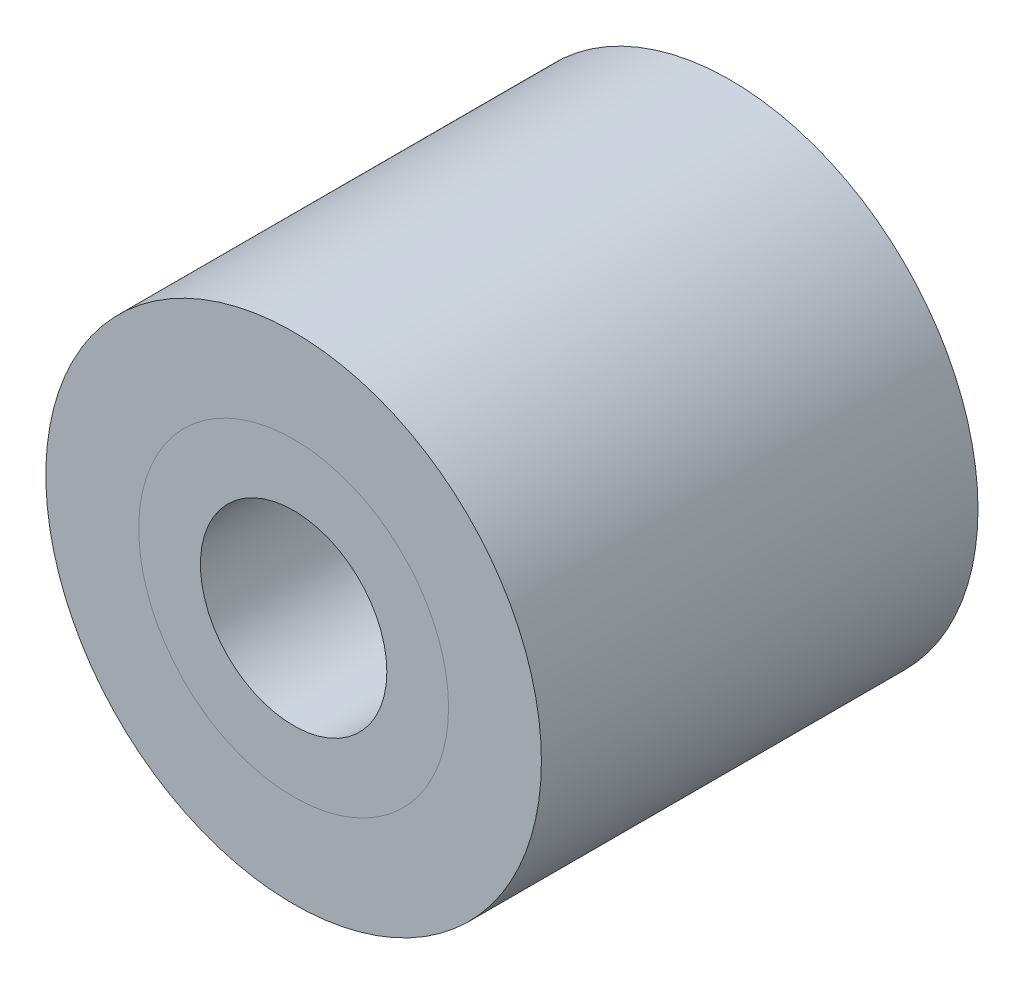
ISO-10303-21;
HEADER;
FILE_DESCRIPTION(('STEP AP214'),'2;1');
FILE_NAME('part.step','',(''),(''),'','','');
FILE_SCHEMA(('AUTOMOTIVE_DESIGN { 1 0 10303 214 1 1 1 1 }'));
ENDSEC;
DATA;
#1=APPLICATION_CONTEXT('core data for automotive mechanical design processes');
#2=APPLICATION_PROTOCOL_DEFINITION('international standard','automotive_design',2000,#1);
#3=PRODUCT_CONTEXT('',#1,'mechanical');
#4=PRODUCT('Part','Part','',(#3));
#5=PRODUCT_RELATED_PRODUCT_CATEGORY('part','',(#4));
#6=PRODUCT_DEFINITION_FORMATION('','',#4);
#7=PRODUCT_DEFINITION_CONTEXT('part definition',#1,'design');
#8=PRODUCT_DEFINITION('design','',#6,#7);
#9=PRODUCT_DEFINITION_SHAPE('','',#8);
#10=(LENGTH_UNIT() NAMED_UNIT(*) SI_UNIT(.MILLI.,.METRE.));
#11=(NAMED_UNIT(*) PLANE_ANGLE_UNIT() SI_UNIT($,.RADIAN.));
#12=(NAMED_UNIT(*) SI_UNIT($,.STERADIAN.) SOLID_ANGLE_UNIT());
#13=UNCERTAINTY_MEASURE_WITH_UNIT(LENGTH_MEASURE(1.E-05),#10,'distance_accuracy_value','');
#14=(GEOMETRIC_REPRESENTATION_CONTEXT(3) GLOBAL_UNCERTAINTY_ASSIGNED_CONTEXT((#13)) GLOBAL_UNIT_ASSIGNED_CONTEXT((#10,
#11,#12)) REPRESENTATION_CONTEXT('',''));
#15=CARTESIAN_POINT('',(0.,0.,0.));
#16=DIRECTION('',(0.,0.,1.));
#17=DIRECTION('',(1.,0.,0.));
#18=AXIS2_PLACEMENT_3D('',#15,#16,#17);
#19=CARTESIAN_POINT('',(0.,0.,-37.01));
#20=DIRECTION('',(0.,0.,1.));
#21=DIRECTION('',(1.,0.,0.));
#22=AXIS2_PLACEMENT_3D('',#19,#20,#21);
#23=CYLINDRICAL_SURFACE('',#22,13.13);
#24=CARTESIAN_POINT('',(0.,0.,0.));
#25=DIRECTION('',(0.,0.,1.));
#26=DIRECTION('',(1.,0.,0.));
#27=AXIS2_PLACEMENT_3D('',#24,#25,#26);
#28=CIRCLE('',#27,13.13);
#29=CARTESIAN_POINT('',(13.13,0.,0.));
#30=VERTEX_POINT('',#29);
#31=EDGE_CURVE('E59',#30,#30,#28,.T.);
#32=ORIENTED_EDGE('',*,*,#31,.F.);
#33=EDGE_LOOP('',(#32));
#34=FACE_BOUND('',#33,.T.);
#35=CARTESIAN_POINT('',(0.,0.,-37.));
#36=DIRECTION('',(0.,0.,1.));
#37=DIRECTION('',(1.,0.,0.));
#38=AXIS2_PLACEMENT_3D('',#35,#36,#37);
#39=CIRCLE('',#38,13.13);
#40=CARTESIAN_POINT('',(13.13,0.,-37.));
#41=VERTEX_POINT('',#40);
#42=EDGE_CURVE('E68',#41,#41,#39,.T.);
#43=ORIENTED_EDGE('',*,*,#42,.T.);
#44=EDGE_LOOP('',(#43));
#45=FACE_BOUND('',#44,.T.);
#46=CARTESIAN_POINT('',(0.,13.13,-20.5));
#47=CARTESIAN_POINT('',(0.111647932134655,13.1299981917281,-20.4999954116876));
#48=CARTESIAN_POINT('',(0.223360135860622,13.1285610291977,-20.4906194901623));
#49=CARTESIAN_POINT('',(0.443660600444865,13.122966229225,-20.4533738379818));
#50=CARTESIAN_POINT('',(0.552245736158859,13.118805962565,-20.4254862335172));
#51=CARTESIAN_POINT('',(0.763072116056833,13.1082323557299,-20.3520710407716));
#52=CARTESIAN_POINT('',(0.86531813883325,13.1018207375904,-20.3065569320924));
#53=CARTESIAN_POINT('',(1.06070636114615,13.0874524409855,-20.199213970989));
#54=CARTESIAN_POINT('',(1.15384979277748,13.0794959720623,-20.1373873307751));
#55=CARTESIAN_POINT('',(1.32915351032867,13.0628508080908,-19.998644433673));
#56=CARTESIAN_POINT('',(1.41122994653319,13.054157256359,-19.9216228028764));
#57=CARTESIAN_POINT('',(1.56134626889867,13.0370556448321,-19.7549030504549));
#58=CARTESIAN_POINT('',(1.6293853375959,13.0286476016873,-19.665204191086));
#59=CARTESIAN_POINT('',(1.74982325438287,13.0130218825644,-19.4751111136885));
#60=CARTESIAN_POINT('',(1.80214073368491,13.0058104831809,-19.3746647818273));
#61=CARTESIAN_POINT('',(1.88913032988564,12.9934610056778,-19.1662823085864));
#62=CARTESIAN_POINT('',(1.92380343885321,12.9883228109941,-19.0583465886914));
#63=CARTESIAN_POINT('',(1.9742591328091,12.9807493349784,-18.8389320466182));
#64=CARTESIAN_POINT('',(1.99018543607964,12.9782935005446,-18.727486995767));
#65=CARTESIAN_POINT('',(2.0031407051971,12.9763004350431,-18.5034812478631));
#66=CARTESIAN_POINT('',(2.00017078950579,12.9767630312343,-18.3909206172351));
#67=CARTESIAN_POINT('',(1.97553532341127,12.9805357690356,-18.1688955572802));
#68=CARTESIAN_POINT('',(1.95403002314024,12.9838215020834,-18.0594128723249));
#69=CARTESIAN_POINT('',(1.8931851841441,12.9928321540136,-17.8456281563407));
#70=CARTESIAN_POINT('',(1.85384512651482,12.9985571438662,-17.7413262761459));
#71=CARTESIAN_POINT('',(1.75828138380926,13.0118281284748,-17.54037739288));
#72=CARTESIAN_POINT('',(1.70198999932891,13.0193814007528,-17.4437630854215));
#73=CARTESIAN_POINT('',(1.57416970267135,13.0354526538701,-17.2612908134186));
#74=CARTESIAN_POINT('',(1.50263975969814,13.0439706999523,-17.1754335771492));
#75=CARTESIAN_POINT('',(1.34549404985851,13.0611194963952,-17.0159840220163));
#76=CARTESIAN_POINT('',(1.25974054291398,13.0697505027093,-16.9425274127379));
#77=CARTESIAN_POINT('',(1.0770509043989,13.0860711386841,-16.8110274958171));
#78=CARTESIAN_POINT('',(0.980114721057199,13.0937607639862,-16.7529842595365));
#79=CARTESIAN_POINT('',(0.777692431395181,13.1073406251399,-16.6539510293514));
#80=CARTESIAN_POINT('',(0.672201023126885,13.1132297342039,-16.6129717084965));
#81=CARTESIAN_POINT('',(0.45572389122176,13.1225356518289,-16.5493486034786));
#82=CARTESIAN_POINT('',(0.344738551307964,13.125952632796,-16.5267035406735));
#83=CARTESIAN_POINT('',(0.121595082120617,13.1299064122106,-16.5005726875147));
#84=CARTESIAN_POINT('',(0.00945927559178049,13.130471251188,-16.4969003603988));
#85=CARTESIAN_POINT('',(-0.21382664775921,13.1287334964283,-16.5083238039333));
#86=CARTESIAN_POINT('',(-0.324976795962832,13.1264309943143,-16.5234189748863));
#87=CARTESIAN_POINT('',(-0.542569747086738,13.1192346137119,-16.5717937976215));
#88=CARTESIAN_POINT('',(-0.649033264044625,13.1143537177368,-16.6049823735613));
#89=CARTESIAN_POINT('',(-0.854884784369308,13.1025459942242,-16.6885057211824));
#90=CARTESIAN_POINT('',(-0.954272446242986,13.0956190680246,-16.7388413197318));
#91=CARTESIAN_POINT('',(-1.14396992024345,13.0804192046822,-16.8556661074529));
#92=CARTESIAN_POINT('',(-1.23420621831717,13.0721365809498,-16.9222733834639));
#93=CARTESIAN_POINT('',(-1.40228651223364,13.0551768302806,-17.0695866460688));
#94=CARTESIAN_POINT('',(-1.48012976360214,13.046499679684,-17.15029347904));
#95=CARTESIAN_POINT('',(-1.6218947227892,13.0296396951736,-17.3243461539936));
#96=CARTESIAN_POINT('',(-1.68569125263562,13.0214617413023,-17.417794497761));
#97=CARTESIAN_POINT('',(-1.79668116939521,13.0066131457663,-17.6141906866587));
#98=CARTESIAN_POINT('',(-1.84387501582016,12.9999424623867,-17.7171382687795));
#99=CARTESIAN_POINT('',(-1.92012679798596,12.9888991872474,-17.9292404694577));
#100=CARTESIAN_POINT('',(-1.94925013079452,12.9845183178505,-18.0383711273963));
#101=CARTESIAN_POINT('',(-1.98874202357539,12.9785288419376,-18.260046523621));
#102=CARTESIAN_POINT('',(-1.99911192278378,12.976920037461,-18.3725910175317));
#103=CARTESIAN_POINT('',(-2.00076998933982,12.9766643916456,-18.5966513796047));
#104=CARTESIAN_POINT('',(-1.99225500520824,12.9779869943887,-18.7081658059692));
#105=CARTESIAN_POINT('',(-1.95680735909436,12.9833786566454,-18.9281567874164));
#106=CARTESIAN_POINT('',(-1.92987473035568,12.9874477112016,-19.036633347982));
#107=CARTESIAN_POINT('',(-1.85842670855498,12.9978629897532,-19.2474119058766));
#108=CARTESIAN_POINT('',(-1.81392550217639,13.0042073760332,-19.3497188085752));
#109=CARTESIAN_POINT('',(-1.70862321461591,13.018460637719,-19.545446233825));
#110=CARTESIAN_POINT('',(-1.64782154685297,13.026369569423,-19.6388664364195));
#111=CARTESIAN_POINT('',(-1.51093077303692,13.0429588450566,-19.8151679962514));
#112=CARTESIAN_POINT('',(-1.43469599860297,13.0516460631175,-19.8979356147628));
#113=CARTESIAN_POINT('',(-1.26941088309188,13.0687560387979,-20.0495728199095));
#114=CARTESIAN_POINT('',(-1.1803575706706,13.077178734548,-20.1184391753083));
#115=CARTESIAN_POINT('',(-0.991366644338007,13.0928654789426,-20.2406699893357));
#116=CARTESIAN_POINT('',(-0.891370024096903,13.1001226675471,-20.2939440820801));
#117=CARTESIAN_POINT('',(-0.683783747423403,13.1125935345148,-20.3828603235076));
#118=CARTESIAN_POINT('',(-0.576202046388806,13.1178093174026,-20.4185206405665));
#119=CARTESIAN_POINT('',(-0.390121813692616,13.1244260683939,-20.4631535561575));
#120=CARTESIAN_POINT('',(-0.3127689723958,13.12650549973,-20.47694972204));
#121=CARTESIAN_POINT('',(-0.156954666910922,13.129293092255,-20.4953744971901));
#122=CARTESIAN_POINT('',(-0.0784932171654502,13.1300012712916,-20.5000032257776));
#123=CARTESIAN_POINT('',(0.,13.13,-20.5));
#124=B_SPLINE_CURVE_WITH_KNOTS('',3,(#46,#47,#48,#49,#50,#51,#52,#53,#54,#55,#56,#57,#58,#59,
#60,#61,#62,#63,#64,#65,#66,#67,#68,#69,#70,#71,#72,#73,#74,#75,#76,#77,#78,#79,#80,#81,#82,#83,
#84,#85,#86,#87,#88,#89,#90,#91,#92,#93,#94,#95,#96,#97,#98,#99,#100,#101,#102,#103,#104,#105,
#106,#107,#108,#109,#110,#111,#112,#113,#114,#115,#116,#117,#118,#119,#120,#121,#122,#123),
.UNSPECIFIED.,.T.,.F.,(4,2,2,2,2,2,2,2,2,2,2,2,2,2,2,2,2,2,2,2,2,2,2,2,2,2,2,2,2,2,2,2,2,2,2,2,
2,2,4),(0.,0.334656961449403,0.669637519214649,1.00436240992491,1.33904193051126,
1.67612958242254,2.01323685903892,2.35205995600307,2.69086400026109,3.02705340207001,
3.36322290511,3.69651483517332,4.02981646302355,4.36446727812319,4.69914073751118,
5.03726782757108,5.37539648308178,5.71373631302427,6.05205254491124,6.38703609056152,
6.72200893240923,7.05531100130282,7.38862914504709,7.72444211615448,8.06027525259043,
8.39898985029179,8.73769507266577,9.07516726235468,9.41261535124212,9.74656256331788,
10.0805091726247,10.4141866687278,10.747876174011,11.0848758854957,11.421953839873,
11.7609483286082,12.0995924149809,12.3348734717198,12.5701514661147),.UNSPECIFIED.);
#125=CARTESIAN_POINT('',(0.,13.13,-20.5));
#126=VERTEX_POINT('',#125);
#127=EDGE_CURVE('E62',#126,#126,#124,.T.);
#128=ORIENTED_EDGE('',*,*,#127,.T.);
#129=EDGE_LOOP('',(#128));
#130=FACE_BOUND('',#129,.T.);
#131=ADVANCED_FACE('F42',(#34,#45,#130),#23,.T.);
#132=CARTESIAN_POINT('',(0.,0.,-37.));
#133=DIRECTION('',(0.,0.,1.));
#134=DIRECTION('',(1.,0.,0.));
#135=AXIS2_PLACEMENT_3D('',#132,#133,#134);
#136=CYLINDRICAL_SURFACE('',#135,7.9);
#137=CARTESIAN_POINT('',(0.,0.,0.));
#138=DIRECTION('',(0.,0.,1.));
#139=DIRECTION('',(1.,0.,0.));
#140=AXIS2_PLACEMENT_3D('',#137,#138,#139);
#141=CIRCLE('',#140,7.9);
#142=CARTESIAN_POINT('',(7.9,0.,0.));
#143=VERTEX_POINT('',#142);
#144=EDGE_CURVE('E11',#143,#143,#141,.T.);
#145=ORIENTED_EDGE('',*,*,#144,.T.);
#146=EDGE_LOOP('',(#145));
#147=FACE_BOUND('',#146,.T.);
#148=CARTESIAN_POINT('',(0.,0.,-37.));
#149=DIRECTION('',(0.,0.,1.));
#150=DIRECTION('',(1.,0.,0.));
#151=AXIS2_PLACEMENT_3D('',#148,#149,#150);
#152=CIRCLE('',#151,7.9);
#153=CARTESIAN_POINT('',(7.9,0.,-37.));
#154=VERTEX_POINT('',#153);
#155=EDGE_CURVE('E54',#154,#154,#152,.T.);
#156=ORIENTED_EDGE('',*,*,#155,.F.);
#157=EDGE_LOOP('',(#156));
#158=FACE_BOUND('',#157,.T.);
#159=CARTESIAN_POINT('',(0.,7.9,-20.5));
#160=CARTESIAN_POINT('',(0.110455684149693,7.89999816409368,-20.4999969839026));
#161=CARTESIAN_POINT('',(0.220944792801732,7.8976604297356,-20.4908188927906));
#162=CARTESIAN_POINT('',(0.438753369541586,7.88856135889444,-20.4544058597));
#163=CARTESIAN_POINT('',(0.5460710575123,7.88179758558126,-20.4271609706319));
#164=CARTESIAN_POINT('',(0.754360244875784,7.86459496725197,-20.3555468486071));
#165=CARTESIAN_POINT('',(0.855339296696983,7.85416059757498,-20.31119846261));
#166=CARTESIAN_POINT('',(1.04842483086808,7.83072646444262,-20.2067103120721));
#167=CARTESIAN_POINT('',(1.14053095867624,7.8177265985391,-20.1465699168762));
#168=CARTESIAN_POINT('',(1.31519757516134,7.79026495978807,-20.0108660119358));
#169=CARTESIAN_POINT('',(1.39754439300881,7.77578017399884,-19.9350321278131));
#170=CARTESIAN_POINT('',(1.54849735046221,7.74713314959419,-19.7706725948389));
#171=CARTESIAN_POINT('',(1.61710189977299,7.73297094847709,-19.6821454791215));
#172=CARTESIAN_POINT('',(1.73963462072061,7.7063399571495,-19.4932447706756));
#173=CARTESIAN_POINT('',(1.7933225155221,7.69390034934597,-19.3927108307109));
#174=CARTESIAN_POINT('',(1.88295228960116,7.67245912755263,-19.1836785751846));
#175=CARTESIAN_POINT('',(1.91889708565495,7.66345694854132,-19.0751815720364));
#176=CARTESIAN_POINT('',(1.97128895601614,7.6501465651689,-18.8556557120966));
#177=CARTESIAN_POINT('',(1.98812081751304,7.64574587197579,-18.7447244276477));
#178=CARTESIAN_POINT('',(2.00300778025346,7.64185997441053,-18.5215320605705));
#179=CARTESIAN_POINT('',(2.00106601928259,7.64237394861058,-18.409271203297));
#180=CARTESIAN_POINT('',(1.97876757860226,7.64817623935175,-18.1895654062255));
#181=CARTESIAN_POINT('',(1.95887071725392,7.65334533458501,-18.082070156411));
#182=CARTESIAN_POINT('',(1.90196093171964,7.66768527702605,-17.871995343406));
#183=CARTESIAN_POINT('',(1.86494676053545,7.67685641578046,-17.769416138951));
#184=CARTESIAN_POINT('',(1.77446439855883,7.69827566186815,-17.5708586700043));
#185=CARTESIAN_POINT('',(1.72083038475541,7.71055453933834,-17.4749594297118));
#186=CARTESIAN_POINT('',(1.59874672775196,7.73678852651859,-17.2933578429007));
#187=CARTESIAN_POINT('',(1.53029443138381,7.7507439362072,-17.2076573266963));
#188=CARTESIAN_POINT('',(1.37814120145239,7.77925948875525,-17.0462523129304));
#189=CARTESIAN_POINT('',(1.29405258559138,7.79382537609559,-16.9709138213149));
#190=CARTESIAN_POINT('',(1.11425951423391,7.82155271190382,-16.8353371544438));
#191=CARTESIAN_POINT('',(1.01855468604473,7.83471411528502,-16.77509946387));
#192=CARTESIAN_POINT('',(0.817715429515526,7.85821780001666,-16.6712950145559));
#193=CARTESIAN_POINT('',(0.712548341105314,7.868549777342,-16.6277889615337));
#194=CARTESIAN_POINT('',(0.496073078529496,7.88515563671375,-16.559176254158));
#195=CARTESIAN_POINT('',(0.384766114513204,7.89143031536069,-16.53406598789));
#196=CARTESIAN_POINT('',(0.162298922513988,7.89909622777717,-16.5035195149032));
#197=CARTESIAN_POINT('',(0.0512112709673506,7.90061111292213,-16.4975850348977));
#198=CARTESIAN_POINT('',(-0.170370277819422,7.89893954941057,-16.5041902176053));
#199=CARTESIAN_POINT('',(-0.28086422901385,7.89575353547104,-16.5167281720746));
#200=CARTESIAN_POINT('',(-0.496381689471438,7.88511751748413,-16.5595119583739));
#201=CARTESIAN_POINT('',(-0.601462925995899,7.87773327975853,-16.5894848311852));
#202=CARTESIAN_POINT('',(-0.805099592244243,7.8595340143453,-16.6659748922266));
#203=CARTESIAN_POINT('',(-0.903654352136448,7.84871863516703,-16.7124937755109));
#204=CARTESIAN_POINT('',(-1.09341434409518,7.82456180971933,-16.8217133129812));
#205=CARTESIAN_POINT('',(-1.18445430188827,7.81117819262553,-16.8846915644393));
#206=CARTESIAN_POINT('',(-1.35485026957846,7.78343409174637,-17.0246883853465));
#207=CARTESIAN_POINT('',(-1.43420420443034,7.76907343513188,-17.1017094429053));
#208=CARTESIAN_POINT('',(-1.58103757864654,7.74054683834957,-17.2699213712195));
#209=CARTESIAN_POINT('',(-1.64816709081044,7.72639494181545,-17.3614206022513));
#210=CARTESIAN_POINT('',(-1.76611992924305,7.70029116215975,-17.5546782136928));
#211=CARTESIAN_POINT('',(-1.81694397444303,7.68833918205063,-17.6564361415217));
#212=CARTESIAN_POINT('',(-1.90046316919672,7.66812147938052,-17.8667820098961));
#213=CARTESIAN_POINT('',(-1.93326558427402,7.65983400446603,-17.9753251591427));
#214=CARTESIAN_POINT('',(-1.98008836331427,7.64786539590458,-18.196628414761));
#215=CARTESIAN_POINT('',(-1.99411296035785,7.64418322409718,-18.3093875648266));
#216=CARTESIAN_POINT('',(-2.00275659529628,7.64192268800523,-18.5323572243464));
#217=CARTESIAN_POINT('',(-1.99793548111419,7.64319707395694,-18.6425448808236));
#218=CARTESIAN_POINT('',(-1.97030906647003,7.65036481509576,-18.8604811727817));
#219=CARTESIAN_POINT('',(-1.94750414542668,7.65625807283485,-18.9682298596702));
#220=CARTESIAN_POINT('',(-1.88486680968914,7.67191641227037,-19.1776031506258));
#221=CARTESIAN_POINT('',(-1.84514192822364,7.68165701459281,-19.2792618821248));
#222=CARTESIAN_POINT('',(-1.74987702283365,7.70391540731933,-19.4745450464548));
#223=CARTESIAN_POINT('',(-1.69433475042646,7.71643359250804,-19.5681683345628));
#224=CARTESIAN_POINT('',(-1.56726739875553,7.74325442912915,-19.7474222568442));
#225=CARTESIAN_POINT('',(-1.49535503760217,7.7575958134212,-19.8327726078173));
#226=CARTESIAN_POINT('',(-1.33834018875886,7.78621875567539,-19.9903765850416));
#227=CARTESIAN_POINT('',(-1.25323456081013,7.80050029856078,-20.0626270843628));
#228=CARTESIAN_POINT('',(-1.07032790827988,7.82771329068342,-20.1933000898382));
#229=CARTESIAN_POINT('',(-0.972319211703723,7.84061449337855,-20.2514386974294));
#230=CARTESIAN_POINT('',(-0.767600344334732,7.86329202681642,-20.3503219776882));
#231=CARTESIAN_POINT('',(-0.660896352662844,7.87307055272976,-20.3910788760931));
#232=CARTESIAN_POINT('',(-0.462016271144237,7.8869886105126,-20.4481268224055));
#233=CARTESIAN_POINT('',(-0.370771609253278,7.89183399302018,-20.4675366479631));
#234=CARTESIAN_POINT('',(-0.18635912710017,7.89834033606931,-20.4934739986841));
#235=CARTESIAN_POINT('',(-0.0931914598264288,7.90000154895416,-20.5000025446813));
#236=CARTESIAN_POINT('',(0.,7.9,-20.5));
#237=B_SPLINE_CURVE_WITH_KNOTS('',3,(#159,#160,#161,#162,#163,#164,#165,#166,#167,#168,#169,
#170,#171,#172,#173,#174,#175,#176,#177,#178,#179,#180,#181,#182,#183,#184,#185,#186,#187,#188,
#189,#190,#191,#192,#193,#194,#195,#196,#197,#198,#199,#200,#201,#202,#203,#204,#205,#206,#207,
#208,#209,#210,#211,#212,#213,#214,#215,#216,#217,#218,#219,#220,#221,#222,#223,#224,#225,#226,
#227,#228,#229,#230,#231,#232,#233,#234,#235,#236),.UNSPECIFIED.,.T.,.F.,(4,2,2,2,2,2,2,2,2,2,2,
2,2,2,2,2,2,2,2,2,2,2,2,2,2,2,2,2,2,2,2,2,2,2,2,2,2,2,4),(0.,0.331025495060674,
0.662233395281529,0.993038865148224,1.32385754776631,1.66093776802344,1.99805697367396,
2.34032744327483,2.68254162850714,3.01773682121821,3.35287599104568,3.67966869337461,
4.00648520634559,4.33667362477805,4.66692121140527,5.00683514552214,5.34675998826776,
5.6879067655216,6.02898654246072,6.36112910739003,6.69324095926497,7.02028814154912,
7.34736883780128,7.68036850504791,8.01342723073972,8.3548852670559,8.69632824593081,
9.03571629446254,9.37502782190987,9.70433716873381,10.0336395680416,10.3608796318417,
10.6881662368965,11.0241948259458,11.3603035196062,11.7026984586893,12.0448521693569,
12.3241605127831,12.6034467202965),.UNSPECIFIED.);
#238=CARTESIAN_POINT('',(0.,7.9,-20.5));
#239=VERTEX_POINT('',#238);
#240=EDGE_CURVE('E46',#239,#239,#237,.T.);
#241=ORIENTED_EDGE('',*,*,#240,.F.);
#242=EDGE_LOOP('',(#241));
#243=FACE_BOUND('',#242,.T.);
#244=ADVANCED_FACE('F80',(#147,#158,#243),#136,.F.);
#245=CARTESIAN_POINT('',(0.,0.,0.));
#246=DIRECTION('',(0.,0.,1.));
#247=DIRECTION('',(1.,0.,0.));
#248=AXIS2_PLACEMENT_3D('',#245,#246,#247);
#249=PLANE('',#248);
#250=ORIENTED_EDGE('',*,*,#144,.F.);
#251=EDGE_LOOP('',(#250));
#252=FACE_BOUND('',#251,.T.);
#253=ORIENTED_EDGE('',*,*,#31,.T.);
#254=EDGE_LOOP('',(#253));
#255=FACE_BOUND('',#254,.T.);
#256=ADVANCED_FACE('F44',(#252,#255),#249,.T.);
#257=CARTESIAN_POINT('',(0.,0.,-37.));
#258=DIRECTION('',(0.,0.,1.));
#259=DIRECTION('',(1.,0.,0.));
#260=AXIS2_PLACEMENT_3D('',#257,#258,#259);
#261=PLANE('',#260);
#262=ORIENTED_EDGE('',*,*,#155,.T.);
#263=EDGE_LOOP('',(#262));
#264=FACE_BOUND('',#263,.T.);
#265=ORIENTED_EDGE('',*,*,#42,.F.);
#266=EDGE_LOOP('',(#265));
#267=FACE_BOUND('',#266,.T.);
#268=ADVANCED_FACE('F86',(#264,#267),#261,.F.);
#269=CARTESIAN_POINT('',(0.,21.,-18.5));
#270=DIRECTION('',(0.,-1.,0.));
#271=DIRECTION('',(0.,0.,-1.));
#272=AXIS2_PLACEMENT_3D('',#269,#270,#271);
#273=CYLINDRICAL_SURFACE('',#272,2.);
#274=ORIENTED_EDGE('',*,*,#127,.F.);
#275=EDGE_LOOP('',(#274));
#276=FACE_BOUND('',#275,.T.);
#277=ORIENTED_EDGE('',*,*,#240,.T.);
#278=EDGE_LOOP('',(#277));
#279=FACE_BOUND('',#278,.T.);
#280=ADVANCED_FACE('F78',(#276,#279),#273,.F.);
#281=CLOSED_SHELL('',(#131,#244,#256,#268,#280));
#282=MANIFOLD_SOLID_BREP('B2',#281);
#283=CARTESIAN_POINT('',(0.,0.,-37.01));
#284=DIRECTION('',(0.,0.,1.));
#285=DIRECTION('',(1.,0.,0.));
#286=AXIS2_PLACEMENT_3D('',#283,#284,#285);
#287=CYLINDRICAL_SURFACE('',#286,13.13);
#288=CARTESIAN_POINT('',(0.,0.,0.));
#289=DIRECTION('',(0.,0.,1.));
#290=DIRECTION('',(1.,0.,0.));
#291=AXIS2_PLACEMENT_3D('',#288,#289,#290);
#292=CIRCLE('',#291,13.13);
#293=CARTESIAN_POINT('',(13.13,0.,0.));
#294=VERTEX_POINT('',#293);
#295=EDGE_CURVE('E41',#294,#294,#292,.T.);
#296=ORIENTED_EDGE('',*,*,#295,.T.);
#297=EDGE_LOOP('',(#296));
#298=FACE_BOUND('',#297,.T.);
#299=CARTESIAN_POINT('',(0.,0.,-37.));
#300=DIRECTION('',(0.,0.,1.));
#301=DIRECTION('',(1.,0.,0.));
#302=AXIS2_PLACEMENT_3D('',#299,#300,#301);
#303=CIRCLE('',#302,13.13);
#304=CARTESIAN_POINT('',(13.13,0.,-37.));
#305=VERTEX_POINT('',#304);
#306=EDGE_CURVE('E135',#305,#305,#303,.T.);
#307=ORIENTED_EDGE('',*,*,#306,.F.);
#308=EDGE_LOOP('',(#307));
#309=FACE_BOUND('',#308,.T.);
#310=ADVANCED_FACE('F132',(#298,#309),#287,.F.);
#311=CARTESIAN_POINT('',(0.,0.,-37.));
#312=DIRECTION('',(0.,0.,1.));
#313=DIRECTION('',(1.,0.,0.));
#314=AXIS2_PLACEMENT_3D('',#311,#312,#313);
#315=CYLINDRICAL_SURFACE('',#314,21.);
#316=CARTESIAN_POINT('',(0.,0.,-37.));
#317=DIRECTION('',(0.,0.,1.));
#318=DIRECTION('',(1.,0.,0.));
#319=AXIS2_PLACEMENT_3D('',#316,#317,#318);
#320=CIRCLE('',#319,21.);
#321=CARTESIAN_POINT('',(21.,0.,-37.));
#322=VERTEX_POINT('',#321);
#323=EDGE_CURVE('E142',#322,#322,#320,.T.);
#324=ORIENTED_EDGE('',*,*,#323,.T.);
#325=EDGE_LOOP('',(#324));
#326=FACE_BOUND('',#325,.T.);
#327=CARTESIAN_POINT('',(0.,0.,0.));
#328=DIRECTION('',(0.,0.,1.));
#329=DIRECTION('',(1.,0.,0.));
#330=AXIS2_PLACEMENT_3D('',#327,#328,#329);
#331=CIRCLE('',#330,21.);
#332=CARTESIAN_POINT('',(21.,0.,0.));
#333=VERTEX_POINT('',#332);
#334=EDGE_CURVE('E144',#333,#333,#331,.T.);
#335=ORIENTED_EDGE('',*,*,#334,.F.);
#336=EDGE_LOOP('',(#335));
#337=FACE_BOUND('',#336,.T.);
#338=ADVANCED_FACE('F150',(#326,#337),#315,.T.);
#339=CARTESIAN_POINT('',(0.,0.,-37.));
#340=DIRECTION('',(0.,0.,1.));
#341=DIRECTION('',(1.,0.,0.));
#342=AXIS2_PLACEMENT_3D('',#339,#340,#341);
#343=PLANE('',#342);
#344=ORIENTED_EDGE('',*,*,#306,.T.);
#345=EDGE_LOOP('',(#344));
#346=FACE_BOUND('',#345,.T.);
#347=ORIENTED_EDGE('',*,*,#323,.F.);
#348=EDGE_LOOP('',(#347));
#349=FACE_BOUND('',#348,.T.);
#350=ADVANCED_FACE('F153',(#346,#349),#343,.F.);
#351=CARTESIAN_POINT('',(0.,0.,0.));
#352=DIRECTION('',(0.,0.,1.));
#353=DIRECTION('',(1.,0.,0.));
#354=AXIS2_PLACEMENT_3D('',#351,#352,#353);
#355=PLANE('',#354);
#356=ORIENTED_EDGE('',*,*,#295,.F.);
#357=EDGE_LOOP('',(#356));
#358=FACE_BOUND('',#357,.T.);
#359=ORIENTED_EDGE('',*,*,#334,.T.);
#360=EDGE_LOOP('',(#359));
#361=FACE_BOUND('',#360,.T.);
#362=ADVANCED_FACE('F155',(#358,#361),#355,.T.);
#363=CLOSED_SHELL('',(#310,#338,#350,#362));
#364=MANIFOLD_SOLID_BREP('B6',#363);
#365=ADVANCED_BREP_SHAPE_REPRESENTATION('',(#18,#282,#364),#14);
#366=SHAPE_DEFINITION_REPRESENTATION(#9,#365);
ENDSEC;
END-ISO-10303-21;
